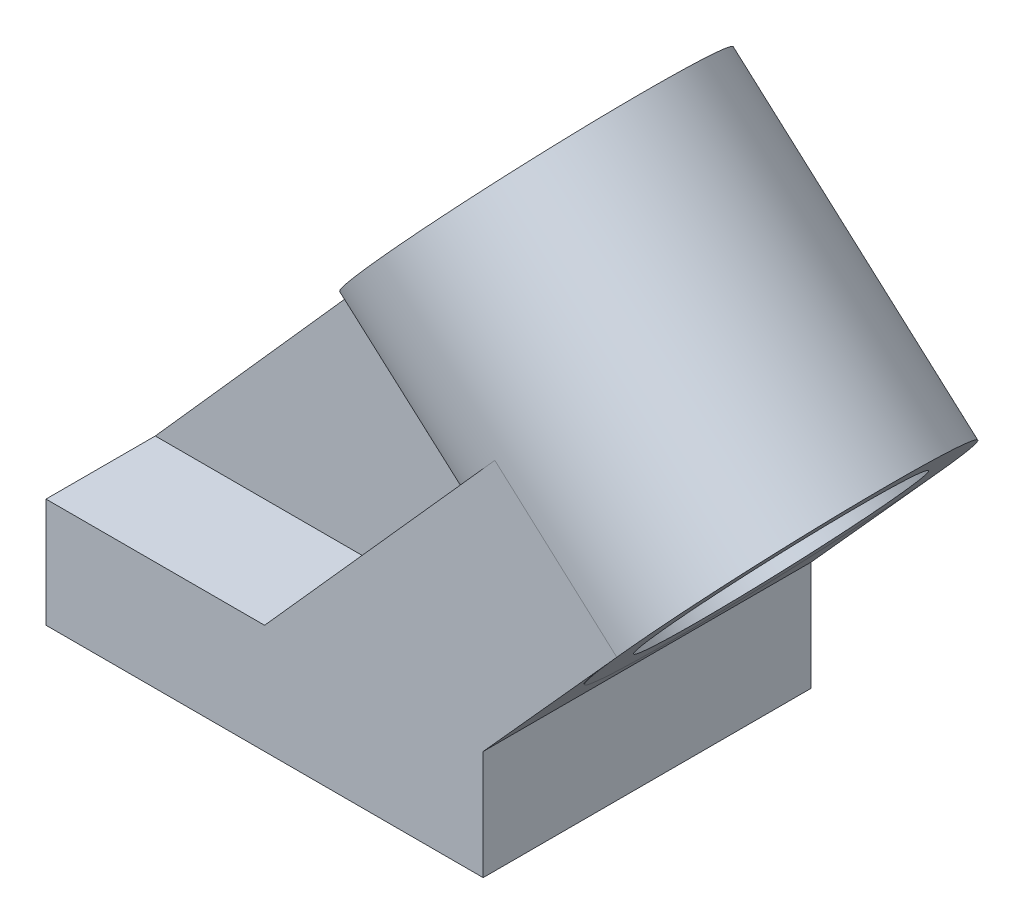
ISO-10303-21;
HEADER;
FILE_DESCRIPTION(('STEP AP214'),'2;1');
FILE_NAME('part.step','',(''),(''),'','','');
FILE_SCHEMA(('AUTOMOTIVE_DESIGN { 1 0 10303 214 1 1 1 1 }'));
ENDSEC;
DATA;
#1=APPLICATION_CONTEXT('core data for automotive mechanical design processes');
#2=APPLICATION_PROTOCOL_DEFINITION('international standard','automotive_design',2000,#1);
#3=PRODUCT_CONTEXT('',#1,'mechanical');
#4=PRODUCT('Part','Part','',(#3));
#5=PRODUCT_RELATED_PRODUCT_CATEGORY('part','',(#4));
#6=PRODUCT_DEFINITION_FORMATION('','',#4);
#7=PRODUCT_DEFINITION_CONTEXT('part definition',#1,'design');
#8=PRODUCT_DEFINITION('design','',#6,#7);
#9=PRODUCT_DEFINITION_SHAPE('','',#8);
#10=(LENGTH_UNIT() NAMED_UNIT(*) SI_UNIT(.MILLI.,.METRE.));
#11=(NAMED_UNIT(*) PLANE_ANGLE_UNIT() SI_UNIT($,.RADIAN.));
#12=(NAMED_UNIT(*) SI_UNIT($,.STERADIAN.) SOLID_ANGLE_UNIT());
#13=UNCERTAINTY_MEASURE_WITH_UNIT(LENGTH_MEASURE(1.E-05),#10,'distance_accuracy_value','');
#14=(GEOMETRIC_REPRESENTATION_CONTEXT(3) GLOBAL_UNCERTAINTY_ASSIGNED_CONTEXT((#13)) GLOBAL_UNIT_ASSIGNED_CONTEXT((#10,
#11,#12)) REPRESENTATION_CONTEXT('',''));
#15=CARTESIAN_POINT('',(0.,0.,0.));
#16=DIRECTION('',(0.,0.,1.));
#17=DIRECTION('',(1.,0.,0.));
#18=AXIS2_PLACEMENT_3D('',#15,#16,#17);
#19=CARTESIAN_POINT('',(-50.8,0.,76.2));
#20=DIRECTION('',(0.,-1.,0.));
#21=DIRECTION('',(0.,0.,-1.));
#22=AXIS2_PLACEMENT_3D('',#19,#20,#21);
#23=PLANE('',#22);
#24=DIRECTION('',(-1.,0.,0.));
#25=VECTOR('',#24,1.);
#26=CARTESIAN_POINT('',(-50.8,0.,25.4));
#27=LINE('',#26,#25);
#28=CARTESIAN_POINT('',(0.,0.,25.4));
#29=VERTEX_POINT('',#28);
#30=CARTESIAN_POINT('',(-50.8,0.,25.4));
#31=VERTEX_POINT('',#30);
#32=EDGE_CURVE('E134',#29,#31,#27,.T.);
#33=ORIENTED_EDGE('',*,*,#32,.F.);
#34=DIRECTION('',(0.,0.,1.));
#35=VECTOR('',#34,1.);
#36=CARTESIAN_POINT('',(0.,0.,0.));
#37=LINE('',#36,#35);
#38=CARTESIAN_POINT('',(0.,0.,0.));
#39=VERTEX_POINT('',#38);
#40=EDGE_CURVE('E207',#39,#29,#37,.T.);
#41=ORIENTED_EDGE('',*,*,#40,.F.);
#42=DIRECTION('',(-1.,0.,0.));
#43=VECTOR('',#42,1.);
#44=CARTESIAN_POINT('',(-50.8,0.,0.));
#45=LINE('',#44,#43);
#46=CARTESIAN_POINT('',(-50.8,0.,0.));
#47=VERTEX_POINT('',#46);
#48=EDGE_CURVE('E156',#39,#47,#45,.T.);
#49=ORIENTED_EDGE('',*,*,#48,.T.);
#50=DIRECTION('',(0.,0.,-1.));
#51=VECTOR('',#50,1.);
#52=CARTESIAN_POINT('',(-50.8,0.,76.2));
#53=LINE('',#52,#51);
#54=EDGE_CURVE('E154',#31,#47,#53,.T.);
#55=ORIENTED_EDGE('',*,*,#54,.F.);
#56=EDGE_LOOP('',(#33,#41,#49,#55));
#57=FACE_BOUND('',#56,.T.);
#58=ADVANCED_FACE('F45',(#57),#23,.F.);
#59=CARTESIAN_POINT('',(0.,0.,0.));
#60=DIRECTION('',(0.746038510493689,-0.665902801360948,0.));
#61=DIRECTION('',(0.665902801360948,0.746038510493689,0.));
#62=AXIS2_PLACEMENT_3D('',#59,#60,#61);
#63=PLANE('',#62);
#64=DIRECTION('',(-0.665902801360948,-0.746038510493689,0.));
#65=VECTOR('',#64,1.);
#66=CARTESIAN_POINT('',(0.,0.,25.4));
#67=LINE('',#66,#65);
#68=CARTESIAN_POINT('',(29.5932807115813,33.1545790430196,25.4));
#69=VERTEX_POINT('',#68);
#70=EDGE_CURVE('E137',#69,#29,#67,.T.);
#71=ORIENTED_EDGE('',*,*,#70,.F.);
#72=CARTESIAN_POINT('',(53.5131915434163,59.9530466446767,38.1));
#73=DIRECTION('',(0.746038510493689,-0.665902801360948,0.));
#74=DIRECTION('',(0.665902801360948,0.746038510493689,0.));
#75=AXIS2_PLACEMENT_3D('',#72,#73,#74);
#76=CIRCLE('',#75,38.1);
#77=CARTESIAN_POINT('',(53.5131915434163,59.9530466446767,0.));
#78=VERTEX_POINT('',#77);
#79=EDGE_CURVE('E189',#69,#78,#76,.T.);
#80=ORIENTED_EDGE('',*,*,#79,.T.);
#81=DIRECTION('',(0.665902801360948,0.746038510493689,0.));
#82=VECTOR('',#81,1.);
#83=CARTESIAN_POINT('',(0.,0.,0.));
#84=LINE('',#83,#82);
#85=EDGE_CURVE('E193',#39,#78,#84,.T.);
#86=ORIENTED_EDGE('',*,*,#85,.F.);
#87=ORIENTED_EDGE('',*,*,#40,.T.);
#88=EDGE_LOOP('',(#71,#80,#86,#87));
#89=FACE_BOUND('',#88,.T.);
#90=ADVANCED_FACE('F236',(#89),#63,.F.);
#91=CARTESIAN_POINT('',(53.5131915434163,59.9530466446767,0.));
#92=DIRECTION('',(-0.6680779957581,-0.744091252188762,0.));
#93=DIRECTION('',(0.744091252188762,-0.6680779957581,0.));
#94=AXIS2_PLACEMENT_3D('',#91,#92,#93);
#95=PLANE('',#94);
#96=DIRECTION('',(0.744091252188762,-0.6680779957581,0.));
#97=VECTOR('',#96,1.);
#98=CARTESIAN_POINT('',(53.5131915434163,59.9530466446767,0.));
#99=LINE('',#98,#97);
#100=CARTESIAN_POINT('',(81.8631890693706,34.4991665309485,0.));
#101=VERTEX_POINT('',#100);
#102=EDGE_CURVE('E190',#78,#101,#99,.T.);
#103=ORIENTED_EDGE('',*,*,#102,.F.);
#104=CARTESIAN_POINT('',(53.5131915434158,59.9530466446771,38.1));
#105=DIRECTION('',(-0.6680779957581,-0.744091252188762,0.));
#106=DIRECTION('',(-0.744091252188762,0.6680779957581,0.));
#107=AXIS2_PLACEMENT_3D('',#104,#105,#106);
#108=ELLIPSE('',#107,13050.342766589,38.1);
#109=CARTESIAN_POINT('',(81.8631890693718,34.4991665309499,0.000162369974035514));
#110=VERTEX_POINT('',#109);
#111=EDGE_CURVE('E184',#78,#110,#108,.T.);
#112=ORIENTED_EDGE('',*,*,#111,.T.);
#113=DIRECTION('',(0.,0.,1.));
#114=VECTOR('',#113,1.);
#115=CARTESIAN_POINT('',(81.8631890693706,34.4991665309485,0.));
#116=LINE('',#115,#114);
#117=EDGE_CURVE('E203',#101,#110,#116,.T.);
#118=ORIENTED_EDGE('',*,*,#117,.F.);
#119=EDGE_LOOP('',(#103,#112,#118));
#120=FACE_BOUND('',#119,.T.);
#121=ADVANCED_FACE('F237',(#120),#95,.F.);
#122=CARTESIAN_POINT('',(0.,0.,50.8));
#123=VERTEX_POINT('',#122);
#124=CARTESIAN_POINT('',(0.,0.,76.2));
#125=VERTEX_POINT('',#124);
#126=EDGE_CURVE('E49',#123,#125,#37,.T.);
#127=ORIENTED_EDGE('',*,*,#126,.F.);
#128=DIRECTION('',(-1.,0.,0.));
#129=VECTOR('',#128,1.);
#130=CARTESIAN_POINT('',(-50.8,0.,50.8));
#131=LINE('',#130,#129);
#132=CARTESIAN_POINT('',(-50.8,0.,50.8));
#133=VERTEX_POINT('',#132);
#134=EDGE_CURVE('E283',#123,#133,#131,.T.);
#135=ORIENTED_EDGE('',*,*,#134,.T.);
#136=CARTESIAN_POINT('',(-50.8,0.,76.2));
#137=VERTEX_POINT('',#136);
#138=EDGE_CURVE('E160',#137,#133,#53,.T.);
#139=ORIENTED_EDGE('',*,*,#138,.F.);
#140=DIRECTION('',(-1.,0.,0.));
#141=VECTOR('',#140,1.);
#142=CARTESIAN_POINT('',(-50.8,0.,76.2));
#143=LINE('',#142,#141);
#144=EDGE_CURVE('E161',#125,#137,#143,.T.);
#145=ORIENTED_EDGE('',*,*,#144,.F.);
#146=EDGE_LOOP('',(#127,#135,#139,#145));
#147=FACE_BOUND('',#146,.T.);
#148=ADVANCED_FACE('F282',(#147),#23,.F.);
#149=CARTESIAN_POINT('',(-50.8,-25.4,76.2));
#150=DIRECTION('',(1.,0.,0.));
#151=DIRECTION('',(0.,0.,-1.));
#152=AXIS2_PLACEMENT_3D('',#149,#150,#151);
#153=PLANE('',#152);
#154=ORIENTED_EDGE('',*,*,#138,.T.);
#155=DIRECTION('',(0.,0.,-1.));
#156=VECTOR('',#155,1.);
#157=CARTESIAN_POINT('',(-50.8,0.,76.2));
#158=LINE('',#157,#156);
#159=EDGE_CURVE('E147',#31,#133,#158,.F.);
#160=ORIENTED_EDGE('',*,*,#159,.F.);
#161=ORIENTED_EDGE('',*,*,#54,.T.);
#162=DIRECTION('',(0.,-1.,0.));
#163=VECTOR('',#162,1.);
#164=CARTESIAN_POINT('',(-50.8,-25.4,0.));
#165=LINE('',#164,#163);
#166=CARTESIAN_POINT('',(-50.8,-25.4,0.));
#167=VERTEX_POINT('',#166);
#168=EDGE_CURVE('E240',#47,#167,#165,.T.);
#169=ORIENTED_EDGE('',*,*,#168,.T.);
#170=DIRECTION('',(0.,0.,-1.));
#171=VECTOR('',#170,1.);
#172=CARTESIAN_POINT('',(-50.8,-25.4,76.2));
#173=LINE('',#172,#171);
#174=CARTESIAN_POINT('',(-50.8,-25.4,76.2));
#175=VERTEX_POINT('',#174);
#176=EDGE_CURVE('E55',#175,#167,#173,.T.);
#177=ORIENTED_EDGE('',*,*,#176,.F.);
#178=DIRECTION('',(0.,-1.,0.));
#179=VECTOR('',#178,1.);
#180=CARTESIAN_POINT('',(-50.8,-25.4,76.2));
#181=LINE('',#180,#179);
#182=EDGE_CURVE('E253',#137,#175,#181,.T.);
#183=ORIENTED_EDGE('',*,*,#182,.F.);
#184=EDGE_LOOP('',(#154,#160,#161,#169,#177,#183));
#185=FACE_BOUND('',#184,.T.);
#186=ADVANCED_FACE('F47',(#185),#153,.F.);
#187=CARTESIAN_POINT('',(50.8,-25.4,76.2));
#188=DIRECTION('',(0.,1.,0.));
#189=DIRECTION('',(-1.,0.,0.));
#190=AXIS2_PLACEMENT_3D('',#187,#188,#189);
#191=PLANE('',#190);
#192=ORIENTED_EDGE('',*,*,#176,.T.);
#193=DIRECTION('',(1.,0.,0.));
#194=VECTOR('',#193,1.);
#195=CARTESIAN_POINT('',(50.8,-25.4,0.));
#196=LINE('',#195,#194);
#197=CARTESIAN_POINT('',(50.8,-25.4,0.));
#198=VERTEX_POINT('',#197);
#199=EDGE_CURVE('E250',#167,#198,#196,.T.);
#200=ORIENTED_EDGE('',*,*,#199,.T.);
#201=DIRECTION('',(0.,0.,-1.));
#202=VECTOR('',#201,1.);
#203=CARTESIAN_POINT('',(50.8,-25.4,76.2));
#204=LINE('',#203,#202);
#205=CARTESIAN_POINT('',(50.8,-25.4,76.2));
#206=VERTEX_POINT('',#205);
#207=EDGE_CURVE('E261',#206,#198,#204,.T.);
#208=ORIENTED_EDGE('',*,*,#207,.F.);
#209=DIRECTION('',(1.,0.,0.));
#210=VECTOR('',#209,1.);
#211=CARTESIAN_POINT('',(50.8,-25.4,76.2));
#212=LINE('',#211,#210);
#213=EDGE_CURVE('E269',#175,#206,#212,.T.);
#214=ORIENTED_EDGE('',*,*,#213,.F.);
#215=EDGE_LOOP('',(#192,#200,#208,#214));
#216=FACE_BOUND('',#215,.T.);
#217=ADVANCED_FACE('F267',(#216),#191,.F.);
#218=CARTESIAN_POINT('',(50.8,0.,76.2));
#219=DIRECTION('',(-1.,0.,0.));
#220=DIRECTION('',(0.,0.,1.));
#221=AXIS2_PLACEMENT_3D('',#218,#219,#220);
#222=PLANE('',#221);
#223=ORIENTED_EDGE('',*,*,#207,.T.);
#224=DIRECTION('',(0.,1.,0.));
#225=VECTOR('',#224,1.);
#226=CARTESIAN_POINT('',(50.8,0.,0.));
#227=LINE('',#226,#225);
#228=CARTESIAN_POINT('',(50.8,0.,0.));
#229=VERTEX_POINT('',#228);
#230=EDGE_CURVE('E248',#198,#229,#227,.T.);
#231=ORIENTED_EDGE('',*,*,#230,.T.);
#232=DIRECTION('',(0.,0.,-1.));
#233=VECTOR('',#232,1.);
#234=CARTESIAN_POINT('',(50.8,0.,76.2));
#235=LINE('',#234,#233);
#236=CARTESIAN_POINT('',(50.8,0.,76.2));
#237=VERTEX_POINT('',#236);
#238=EDGE_CURVE('E244',#237,#229,#235,.T.);
#239=ORIENTED_EDGE('',*,*,#238,.F.);
#240=DIRECTION('',(0.,1.,0.));
#241=VECTOR('',#240,1.);
#242=CARTESIAN_POINT('',(50.8,0.,76.2));
#243=LINE('',#242,#241);
#244=EDGE_CURVE('E265',#206,#237,#243,.T.);
#245=ORIENTED_EDGE('',*,*,#244,.F.);
#246=EDGE_LOOP('',(#223,#231,#239,#245));
#247=FACE_BOUND('',#246,.T.);
#248=ADVANCED_FACE('F264',(#247),#222,.F.);
#249=CARTESIAN_POINT('',(0.,0.,76.2));
#250=DIRECTION('',(0.,0.,-1.));
#251=DIRECTION('',(-1.,0.,0.));
#252=AXIS2_PLACEMENT_3D('',#249,#250,#251);
#253=PLANE('',#252);
#254=ORIENTED_EDGE('',*,*,#182,.T.);
#255=ORIENTED_EDGE('',*,*,#213,.T.);
#256=ORIENTED_EDGE('',*,*,#244,.T.);
#257=DIRECTION('',(0.669130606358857,0.743144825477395,0.));
#258=VECTOR('',#257,1.);
#259=CARTESIAN_POINT('',(50.8,0.,76.2));
#260=LINE('',#259,#258);
#261=CARTESIAN_POINT('',(81.8631890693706,34.4991665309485,76.2));
#262=VERTEX_POINT('',#261);
#263=EDGE_CURVE('E199',#237,#262,#260,.T.);
#264=ORIENTED_EDGE('',*,*,#263,.T.);
#265=DIRECTION('',(0.744091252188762,-0.6680779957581,0.));
#266=VECTOR('',#265,1.);
#267=CARTESIAN_POINT('',(53.5131915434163,59.9530466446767,76.2));
#268=LINE('',#267,#266);
#269=CARTESIAN_POINT('',(53.5131915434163,59.9530466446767,76.2));
#270=VERTEX_POINT('',#269);
#271=EDGE_CURVE('E196',#270,#262,#268,.T.);
#272=ORIENTED_EDGE('',*,*,#271,.F.);
#273=DIRECTION('',(0.665902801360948,0.746038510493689,0.));
#274=VECTOR('',#273,1.);
#275=CARTESIAN_POINT('',(0.,0.,76.2));
#276=LINE('',#275,#274);
#277=EDGE_CURVE('E188',#125,#270,#276,.T.);
#278=ORIENTED_EDGE('',*,*,#277,.F.);
#279=ORIENTED_EDGE('',*,*,#144,.T.);
#280=EDGE_LOOP('',(#254,#255,#256,#264,#272,#278,#279));
#281=FACE_BOUND('',#280,.T.);
#282=ADVANCED_FACE('F275',(#281),#253,.F.);
#283=CARTESIAN_POINT('',(0.,0.,0.));
#284=DIRECTION('',(0.,0.,-1.));
#285=DIRECTION('',(-1.,0.,0.));
#286=AXIS2_PLACEMENT_3D('',#283,#284,#285);
#287=PLANE('',#286);
#288=ORIENTED_EDGE('',*,*,#168,.F.);
#289=ORIENTED_EDGE('',*,*,#48,.F.);
#290=ORIENTED_EDGE('',*,*,#85,.T.);
#291=ORIENTED_EDGE('',*,*,#102,.T.);
#292=DIRECTION('',(0.669130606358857,0.743144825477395,0.));
#293=VECTOR('',#292,1.);
#294=CARTESIAN_POINT('',(50.8,0.,0.));
#295=LINE('',#294,#293);
#296=EDGE_CURVE('E192',#229,#101,#295,.T.);
#297=ORIENTED_EDGE('',*,*,#296,.F.);
#298=ORIENTED_EDGE('',*,*,#230,.F.);
#299=ORIENTED_EDGE('',*,*,#199,.F.);
#300=EDGE_LOOP('',(#288,#289,#290,#291,#297,#298,#299));
#301=FACE_BOUND('',#300,.T.);
#302=ADVANCED_FACE('F223',(#301),#287,.T.);
#303=CARTESIAN_POINT('',(29.5932807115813,33.1545790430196,50.8));
#304=VERTEX_POINT('',#303);
#305=EDGE_CURVE('E185',#270,#304,#76,.T.);
#306=ORIENTED_EDGE('',*,*,#305,.T.);
#307=DIRECTION('',(-0.665902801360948,-0.746038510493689,0.));
#308=VECTOR('',#307,1.);
#309=CARTESIAN_POINT('',(0.,0.,50.8));
#310=LINE('',#309,#308);
#311=EDGE_CURVE('E286',#304,#123,#310,.T.);
#312=ORIENTED_EDGE('',*,*,#311,.T.);
#313=ORIENTED_EDGE('',*,*,#126,.T.);
#314=ORIENTED_EDGE('',*,*,#277,.T.);
#315=EDGE_LOOP('',(#306,#312,#313,#314));
#316=FACE_BOUND('',#315,.T.);
#317=ADVANCED_FACE('F297',(#316),#63,.F.);
#318=CARTESIAN_POINT('',(81.8631890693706,34.4991665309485,76.1998376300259));
#319=VERTEX_POINT('',#318);
#320=EDGE_CURVE('E210',#319,#262,#116,.T.);
#321=ORIENTED_EDGE('',*,*,#320,.F.);
#322=EDGE_CURVE('E182',#319,#270,#108,.T.);
#323=ORIENTED_EDGE('',*,*,#322,.T.);
#324=ORIENTED_EDGE('',*,*,#271,.T.);
#325=EDGE_LOOP('',(#321,#323,#324));
#326=FACE_BOUND('',#325,.T.);
#327=ADVANCED_FACE('F299',(#326),#95,.F.);
#328=CARTESIAN_POINT('',(50.8,0.,0.));
#329=DIRECTION('',(0.743144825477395,-0.669130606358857,0.));
#330=DIRECTION('',(0.669130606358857,0.743144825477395,0.));
#331=AXIS2_PLACEMENT_3D('',#328,#329,#330);
#332=PLANE('',#331);
#333=ORIENTED_EDGE('',*,*,#238,.T.);
#334=ORIENTED_EDGE('',*,*,#296,.T.);
#335=ORIENTED_EDGE('',*,*,#117,.T.);
#336=CARTESIAN_POINT('',(81.9376185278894,34.5818288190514,38.1));
#337=DIRECTION('',(0.743144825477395,-0.669130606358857,0.));
#338=DIRECTION('',(-0.669130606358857,-0.743144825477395,0.));
#339=AXIS2_PLACEMENT_3D('',#336,#337,#338);
#340=ELLIPSE('',#339,38.1003579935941,38.1);
#341=EDGE_CURVE('E13',#319,#110,#340,.T.);
#342=ORIENTED_EDGE('',*,*,#341,.F.);
#343=ORIENTED_EDGE('',*,*,#320,.T.);
#344=ORIENTED_EDGE('',*,*,#263,.F.);
#345=EDGE_LOOP('',(#333,#334,#335,#342,#343,#344));
#346=FACE_BOUND('',#345,.T.);
#347=ADVANCED_FACE('F241',(#346),#332,.T.);
#348=CARTESIAN_POINT('',(81.9372587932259,34.5821499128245,38.1));
#349=DIRECTION('',(-0.746038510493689,0.665902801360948,0.));
#350=DIRECTION('',(-0.665902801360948,-0.746038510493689,0.));
#351=AXIS2_PLACEMENT_3D('',#348,#349,#350);
#352=CYLINDRICAL_SURFACE('',#351,38.1);
#353=CARTESIAN_POINT('',(81.9372587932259,34.5821499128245,38.1));
#354=DIRECTION('',(-0.746038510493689,0.665902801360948,0.));
#355=DIRECTION('',(-0.665902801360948,-0.746038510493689,0.));
#356=AXIS2_PLACEMENT_3D('',#353,#354,#355);
#357=CIRCLE('',#356,38.1);
#358=EDGE_CURVE('E180',#319,#110,#357,.T.);
#359=ORIENTED_EDGE('',*,*,#358,.T.);
#360=ORIENTED_EDGE('',*,*,#111,.F.);
#361=ORIENTED_EDGE('',*,*,#79,.F.);
#362=DIRECTION('',(-0.746038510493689,0.665902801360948,0.));
#363=VECTOR('',#362,1.);
#364=CARTESIAN_POINT('',(58.0173479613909,7.78368231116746,25.4));
#365=LINE('',#364,#363);
#366=CARTESIAN_POINT('',(1.18440607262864,58.5119150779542,25.4));
#367=VERTEX_POINT('',#366);
#368=EDGE_CURVE('E287',#69,#367,#365,.T.);
#369=ORIENTED_EDGE('',*,*,#368,.T.);
#370=CARTESIAN_POINT('',(25.042385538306,85.3656616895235,38.1));
#371=DIRECTION('',(0.747575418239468,-0.664176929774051,0.));
#372=DIRECTION('',(0.664176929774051,0.747575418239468,0.));
#373=AXIS2_PLACEMENT_3D('',#370,#371,#372);
#374=ELLIPSE('',#373,38.1001017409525,38.1);
#375=CARTESIAN_POINT('',(1.18440607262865,58.5119150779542,50.8));
#376=VERTEX_POINT('',#375);
#377=EDGE_CURVE('E150',#376,#367,#374,.T.);
#378=ORIENTED_EDGE('',*,*,#377,.F.);
#379=DIRECTION('',(-0.746038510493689,0.665902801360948,0.));
#380=VECTOR('',#379,1.);
#381=CARTESIAN_POINT('',(58.0173479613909,7.78368231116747,50.8));
#382=LINE('',#381,#380);
#383=EDGE_CURVE('E171',#304,#376,#382,.T.);
#384=ORIENTED_EDGE('',*,*,#383,.F.);
#385=ORIENTED_EDGE('',*,*,#305,.F.);
#386=ORIENTED_EDGE('',*,*,#322,.F.);
#387=EDGE_LOOP('',(#359,#360,#361,#369,#378,#384,#385,#386));
#388=FACE_BOUND('',#387,.T.);
#389=CARTESIAN_POINT('',(25.0891242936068,85.3239433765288,38.1));
#390=DIRECTION('',(-0.746038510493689,0.665902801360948,0.));
#391=DIRECTION('',(-0.665902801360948,-0.746038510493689,0.));
#392=AXIS2_PLACEMENT_3D('',#389,#390,#391);
#393=CIRCLE('',#392,38.1);
#394=CARTESIAN_POINT('',(-0.28177243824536,56.8998761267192,38.1));
#395=VERTEX_POINT('',#394);
#396=EDGE_CURVE('E169',#395,#395,#393,.T.);
#397=ORIENTED_EDGE('',*,*,#396,.F.);
#398=EDGE_LOOP('',(#397));
#399=FACE_BOUND('',#398,.T.);
#400=ADVANCED_FACE('F231',(#388,#399),#352,.T.);
#401=CARTESIAN_POINT('',(81.9372587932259,34.5821499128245,38.1));
#402=DIRECTION('',(-0.746038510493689,0.665902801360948,0.));
#403=DIRECTION('',(-0.665902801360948,-0.746038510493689,0.));
#404=AXIS2_PLACEMENT_3D('',#401,#402,#403);
#405=PLANE('',#404);
#406=CARTESIAN_POINT('',(81.9372587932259,34.5821499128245,38.1));
#407=DIRECTION('',(-0.746038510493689,0.665902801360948,0.));
#408=DIRECTION('',(-0.665902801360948,-0.746038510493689,0.));
#409=AXIS2_PLACEMENT_3D('',#406,#407,#408);
#410=CIRCLE('',#409,28.575);
#411=CARTESIAN_POINT('',(62.9090862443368,13.2640994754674,38.1));
#412=VERTEX_POINT('',#411);
#413=EDGE_CURVE('E177',#412,#412,#410,.T.);
#414=ORIENTED_EDGE('',*,*,#413,.T.);
#415=EDGE_LOOP('',(#414));
#416=FACE_BOUND('',#415,.T.);
#417=ORIENTED_EDGE('',*,*,#358,.F.);
#418=EDGE_CURVE('E68',#110,#319,#357,.T.);
#419=ORIENTED_EDGE('',*,*,#418,.F.);
#420=EDGE_LOOP('',(#417,#419));
#421=FACE_BOUND('',#420,.T.);
#422=ADVANCED_FACE('F330',(#416,#421),#405,.F.);
#423=CARTESIAN_POINT('',(81.9372587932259,34.5821499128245,38.1));
#424=DIRECTION('',(-0.746038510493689,0.665902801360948,0.));
#425=DIRECTION('',(-0.665902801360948,-0.746038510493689,0.));
#426=AXIS2_PLACEMENT_3D('',#423,#424,#425);
#427=CYLINDRICAL_SURFACE('',#426,28.575);
#428=ORIENTED_EDGE('',*,*,#413,.F.);
#429=EDGE_LOOP('',(#428));
#430=FACE_BOUND('',#429,.T.);
#431=CARTESIAN_POINT('',(25.0891242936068,85.3239433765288,38.1));
#432=DIRECTION('',(-0.746038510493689,0.665902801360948,0.));
#433=DIRECTION('',(-0.665902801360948,-0.746038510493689,0.));
#434=AXIS2_PLACEMENT_3D('',#431,#432,#433);
#435=CIRCLE('',#434,28.575);
#436=CARTESIAN_POINT('',(6.06095174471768,64.0058929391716,38.1));
#437=VERTEX_POINT('',#436);
#438=EDGE_CURVE('E166',#437,#437,#435,.T.);
#439=ORIENTED_EDGE('',*,*,#438,.T.);
#440=EDGE_LOOP('',(#439));
#441=FACE_BOUND('',#440,.T.);
#442=ADVANCED_FACE('F329',(#430,#441),#427,.F.);
#443=ORIENTED_EDGE('',*,*,#341,.T.);
#444=ORIENTED_EDGE('',*,*,#418,.T.);
#445=EDGE_LOOP('',(#443,#444));
#446=FACE_BOUND('',#445,.T.);
#447=ADVANCED_FACE('F325',(#446),#352,.T.);
#448=CARTESIAN_POINT('',(25.0891242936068,85.3239433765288,38.1));
#449=DIRECTION('',(-0.746038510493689,0.665902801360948,0.));
#450=DIRECTION('',(-0.665902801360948,-0.746038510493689,0.));
#451=AXIS2_PLACEMENT_3D('',#448,#449,#450);
#452=PLANE('',#451);
#453=ORIENTED_EDGE('',*,*,#438,.F.);
#454=EDGE_LOOP('',(#453));
#455=FACE_BOUND('',#454,.T.);
#456=ORIENTED_EDGE('',*,*,#396,.T.);
#457=EDGE_LOOP('',(#456));
#458=FACE_BOUND('',#457,.T.);
#459=ADVANCED_FACE('F328',(#455,#458),#452,.T.);
#460=CARTESIAN_POINT('',(-50.8,0.,38.1));
#461=DIRECTION('',(0.747575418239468,-0.664176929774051,0.));
#462=DIRECTION('',(0.664176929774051,0.747575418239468,0.));
#463=AXIS2_PLACEMENT_3D('',#460,#461,#462);
#464=PLANE('',#463);
#465=DIRECTION('',(0.664176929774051,0.747575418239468,0.));
#466=VECTOR('',#465,1.);
#467=CARTESIAN_POINT('',(-50.8,0.,25.4));
#468=LINE('',#467,#466);
#469=EDGE_CURVE('E62',#31,#367,#468,.T.);
#470=ORIENTED_EDGE('',*,*,#469,.F.);
#471=ORIENTED_EDGE('',*,*,#159,.T.);
#472=DIRECTION('',(0.664176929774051,0.747575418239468,0.));
#473=VECTOR('',#472,1.);
#474=CARTESIAN_POINT('',(-50.8,0.,50.8));
#475=LINE('',#474,#473);
#476=EDGE_CURVE('E141',#133,#376,#475,.T.);
#477=ORIENTED_EDGE('',*,*,#476,.T.);
#478=ORIENTED_EDGE('',*,*,#377,.T.);
#479=EDGE_LOOP('',(#470,#471,#477,#478));
#480=FACE_BOUND('',#479,.T.);
#481=ADVANCED_FACE('F144',(#480),#464,.F.);
#482=CARTESIAN_POINT('',(28.254065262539,44.1740053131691,50.8));
#483=DIRECTION('',(0.,0.,1.));
#484=DIRECTION('',(1.,0.,0.));
#485=AXIS2_PLACEMENT_3D('',#482,#483,#484);
#486=PLANE('',#485);
#487=ORIENTED_EDGE('',*,*,#311,.F.);
#488=ORIENTED_EDGE('',*,*,#383,.T.);
#489=ORIENTED_EDGE('',*,*,#476,.F.);
#490=ORIENTED_EDGE('',*,*,#134,.F.);
#491=EDGE_LOOP('',(#487,#488,#489,#490));
#492=FACE_BOUND('',#491,.T.);
#493=ADVANCED_FACE('F293',(#492),#486,.T.);
#494=CARTESIAN_POINT('',(28.254065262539,44.1740053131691,25.4));
#495=DIRECTION('',(0.,0.,1.));
#496=DIRECTION('',(1.,0.,0.));
#497=AXIS2_PLACEMENT_3D('',#494,#495,#496);
#498=PLANE('',#497);
#499=ORIENTED_EDGE('',*,*,#368,.F.);
#500=ORIENTED_EDGE('',*,*,#70,.T.);
#501=ORIENTED_EDGE('',*,*,#32,.T.);
#502=ORIENTED_EDGE('',*,*,#469,.T.);
#503=EDGE_LOOP('',(#499,#500,#501,#502));
#504=FACE_BOUND('',#503,.T.);
#505=ADVANCED_FACE('F135',(#504),#498,.F.);
#506=CLOSED_SHELL('',(#58,#90,#121,#148,#186,#217,#248,#282,#302,#317,#327,#347,#400,#422,#442,
#447,#459,#481,#493,#505));
#507=MANIFOLD_SOLID_BREP('B2',#506);
#508=ADVANCED_BREP_SHAPE_REPRESENTATION('',(#18,#507),#14);
#509=SHAPE_DEFINITION_REPRESENTATION(#9,#508);
ENDSEC;
END-ISO-10303-21;
